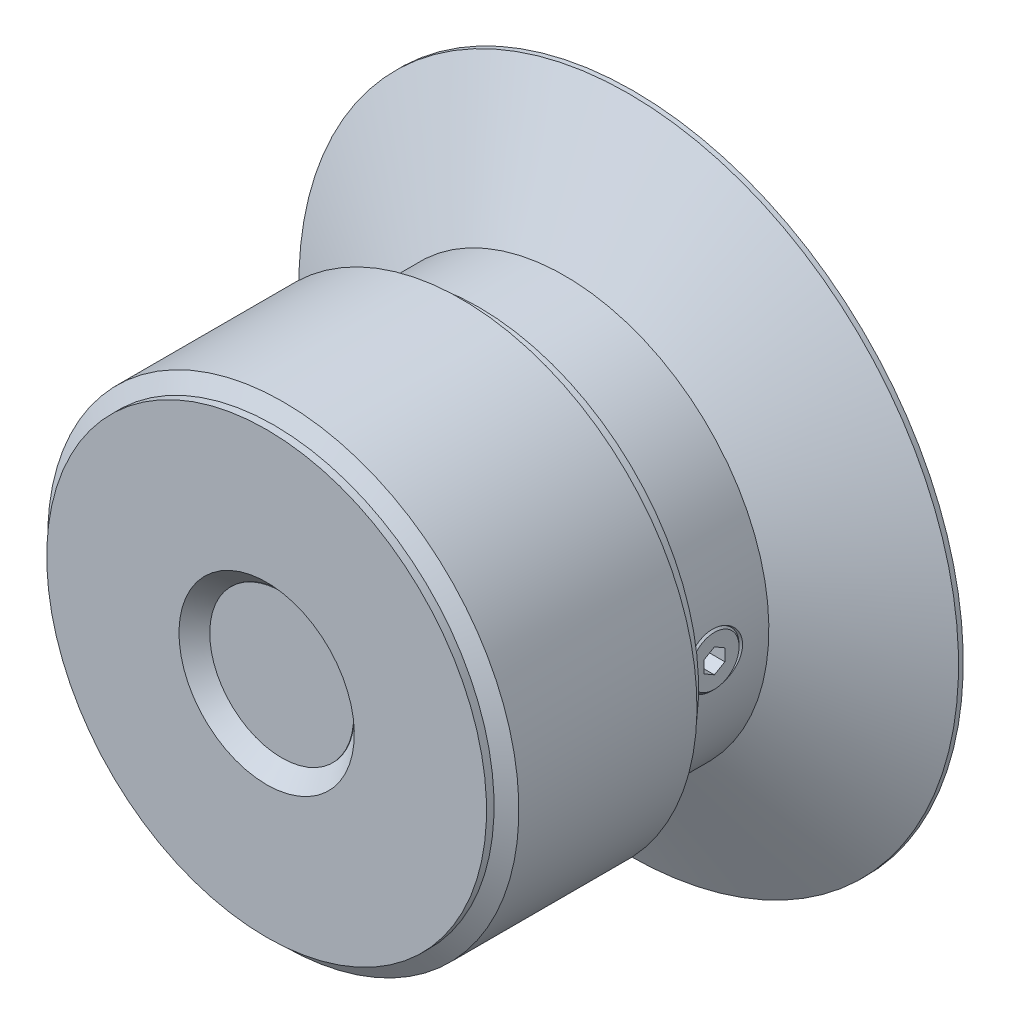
ISO-10303-21;
HEADER;
FILE_DESCRIPTION(('STEP AP214'),'2;1');
FILE_NAME('part.step','',(''),(''),'','','');
FILE_SCHEMA(('AUTOMOTIVE_DESIGN { 1 0 10303 214 1 1 1 1 }'));
ENDSEC;
DATA;
#1=APPLICATION_CONTEXT('core data for automotive mechanical design processes');
#2=APPLICATION_PROTOCOL_DEFINITION('international standard','automotive_design',2000,#1);
#3=PRODUCT_CONTEXT('',#1,'mechanical');
#4=PRODUCT('Part','Part','',(#3));
#5=PRODUCT_RELATED_PRODUCT_CATEGORY('part','',(#4));
#6=PRODUCT_DEFINITION_FORMATION('','',#4);
#7=PRODUCT_DEFINITION_CONTEXT('part definition',#1,'design');
#8=PRODUCT_DEFINITION('design','',#6,#7);
#9=PRODUCT_DEFINITION_SHAPE('','',#8);
#10=(LENGTH_UNIT() NAMED_UNIT(*) SI_UNIT(.MILLI.,.METRE.));
#11=(NAMED_UNIT(*) PLANE_ANGLE_UNIT() SI_UNIT($,.RADIAN.));
#12=(NAMED_UNIT(*) SI_UNIT($,.STERADIAN.) SOLID_ANGLE_UNIT());
#13=UNCERTAINTY_MEASURE_WITH_UNIT(LENGTH_MEASURE(1.E-05),#10,'distance_accuracy_value','');
#14=(GEOMETRIC_REPRESENTATION_CONTEXT(3) GLOBAL_UNCERTAINTY_ASSIGNED_CONTEXT((#13)) GLOBAL_UNIT_ASSIGNED_CONTEXT((#10,
#11,#12)) REPRESENTATION_CONTEXT('',''));
#15=CARTESIAN_POINT('',(0.,0.,0.));
#16=DIRECTION('',(0.,0.,1.));
#17=DIRECTION('',(1.,0.,0.));
#18=AXIS2_PLACEMENT_3D('',#15,#16,#17);
#19=CARTESIAN_POINT('',(0.,0.,15.7320508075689));
#20=DIRECTION('',(0.,0.,1.));
#21=DIRECTION('',(0.,-1.,0.));
#22=AXIS2_PLACEMENT_3D('',#19,#20,#21);
#23=CYLINDRICAL_SURFACE('',#22,3.);
#24=CARTESIAN_POINT('',(0.,0.,0.2));
#25=DIRECTION('',(0.,0.,1.));
#26=DIRECTION('',(0.,-1.,0.));
#27=AXIS2_PLACEMENT_3D('',#24,#25,#26);
#28=CIRCLE('',#27,3.);
#29=CARTESIAN_POINT('',(0.,-3.,0.2));
#30=VERTEX_POINT('',#29);
#31=EDGE_CURVE('E138',#30,#30,#28,.T.);
#32=ORIENTED_EDGE('',*,*,#31,.F.);
#33=EDGE_LOOP('',(#32));
#34=FACE_BOUND('',#33,.T.);
#35=CARTESIAN_POINT('',(0.,0.,14.));
#36=DIRECTION('',(0.,0.,-1.));
#37=DIRECTION('',(0.,1.,0.));
#38=AXIS2_PLACEMENT_3D('',#35,#36,#37);
#39=CIRCLE('',#38,3.);
#40=CARTESIAN_POINT('',(0.,3.,14.));
#41=VERTEX_POINT('',#40);
#42=EDGE_CURVE('E90',#41,#41,#39,.T.);
#43=ORIENTED_EDGE('',*,*,#42,.F.);
#44=EDGE_LOOP('',(#43));
#45=FACE_BOUND('',#44,.T.);
#46=ADVANCED_FACE('F14',(#34,#45),#23,.F.);
#47=CARTESIAN_POINT('',(0.,0.,0.));
#48=DIRECTION('',(0.,0.,-1.));
#49=DIRECTION('',(0.,1.,0.));
#50=AXIS2_PLACEMENT_3D('',#47,#48,#49);
#51=CONICAL_SURFACE('',#50,3.2,0.785398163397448);
#52=ORIENTED_EDGE('',*,*,#31,.T.);
#53=EDGE_LOOP('',(#52));
#54=FACE_BOUND('',#53,.T.);
#55=CARTESIAN_POINT('',(0.,0.,0.));
#56=DIRECTION('',(0.,0.,1.));
#57=DIRECTION('',(0.,-1.,0.));
#58=AXIS2_PLACEMENT_3D('',#55,#56,#57);
#59=CIRCLE('',#58,3.2);
#60=CARTESIAN_POINT('',(0.,-3.2,0.));
#61=VERTEX_POINT('',#60);
#62=EDGE_CURVE('E141',#61,#61,#59,.T.);
#63=ORIENTED_EDGE('',*,*,#62,.F.);
#64=EDGE_LOOP('',(#63));
#65=FACE_BOUND('',#64,.T.);
#66=ADVANCED_FACE('F165',(#54,#65),#51,.F.);
#67=CARTESIAN_POINT('',(0.,0.,0.));
#68=DIRECTION('',(0.,0.,1.));
#69=DIRECTION('',(0.,-1.,0.));
#70=AXIS2_PLACEMENT_3D('',#67,#68,#69);
#71=PLANE('',#70);
#72=CARTESIAN_POINT('',(0.,0.,0.));
#73=DIRECTION('',(0.,0.,1.));
#74=DIRECTION('',(0.,-1.,0.));
#75=AXIS2_PLACEMENT_3D('',#72,#73,#74);
#76=CIRCLE('',#75,6.);
#77=CARTESIAN_POINT('',(0.,-6.,0.));
#78=VERTEX_POINT('',#77);
#79=EDGE_CURVE('E509',#78,#78,#76,.T.);
#80=ORIENTED_EDGE('',*,*,#79,.F.);
#81=EDGE_LOOP('',(#80));
#82=FACE_BOUND('',#81,.T.);
#83=ORIENTED_EDGE('',*,*,#62,.T.);
#84=EDGE_LOOP('',(#83));
#85=FACE_BOUND('',#84,.T.);
#86=ADVANCED_FACE('F227',(#82,#85),#71,.F.);
#87=CARTESIAN_POINT('',(0.,0.,24.));
#88=DIRECTION('',(0.,0.,1.));
#89=DIRECTION('',(0.,-1.,0.));
#90=AXIS2_PLACEMENT_3D('',#87,#88,#89);
#91=CYLINDRICAL_SURFACE('',#90,6.);
#92=CARTESIAN_POINT('',(0.,0.,0.3));
#93=DIRECTION('',(0.,0.,1.));
#94=DIRECTION('',(0.,-1.,0.));
#95=AXIS2_PLACEMENT_3D('',#92,#93,#94);
#96=CIRCLE('',#95,6.);
#97=CARTESIAN_POINT('',(0.,-6.,0.3));
#98=VERTEX_POINT('',#97);
#99=EDGE_CURVE('E506',#98,#98,#96,.T.);
#100=ORIENTED_EDGE('',*,*,#99,.F.);
#101=EDGE_LOOP('',(#100));
#102=FACE_BOUND('',#101,.T.);
#103=ORIENTED_EDGE('',*,*,#79,.T.);
#104=EDGE_LOOP('',(#103));
#105=FACE_BOUND('',#104,.T.);
#106=ADVANCED_FACE('F163',(#102,#105),#91,.T.);
#107=CARTESIAN_POINT('',(13.2,0.,8.5));
#108=DIRECTION('',(1.,0.,0.));
#109=DIRECTION('',(0.,0.,-1.));
#110=AXIS2_PLACEMENT_3D('',#107,#108,#109);
#111=CONICAL_SURFACE('',#110,2.,0.78539816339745);
#112=CARTESIAN_POINT('',(12.9431972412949,-1.2139378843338,7.24896385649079));
#113=CARTESIAN_POINT('',(12.9486321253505,-1.15598715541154,7.18515845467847));
#114=CARTESIAN_POINT('',(12.95411531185,-1.09333814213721,7.12561511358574));
#115=CARTESIAN_POINT('',(12.9646981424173,-0.959734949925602,7.01659920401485));
#116=CARTESIAN_POINT('',(12.9697976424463,-0.888777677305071,6.96713040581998));
#117=CARTESIAN_POINT('',(12.9796922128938,-0.731114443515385,6.8745582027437));
#118=CARTESIAN_POINT('',(12.9843791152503,-0.643539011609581,6.83290954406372));
#119=CARTESIAN_POINT('',(12.9920939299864,-0.462285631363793,6.76586842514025));
#120=CARTESIAN_POINT('',(12.9951219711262,-0.368608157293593,6.74047470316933));
#121=CARTESIAN_POINT('',(12.9990116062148,-0.183704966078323,6.70807803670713));
#122=CARTESIAN_POINT('',(12.9999889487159,-0.0926534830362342,6.700091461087));
#123=CARTESIAN_POINT('',(13.0000108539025,0.089449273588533,6.69991016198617));
#124=CARTESIAN_POINT('',(12.9990559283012,0.180500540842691,6.70771125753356));
#125=CARTESIAN_POINT('',(12.9953821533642,0.357267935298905,6.73830549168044));
#126=CARTESIAN_POINT('',(12.9927152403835,0.443062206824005,6.76065747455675));
#127=CARTESIAN_POINT('',(12.9859588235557,0.609788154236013,6.81904806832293));
#128=CARTESIAN_POINT('',(12.9818691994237,0.690719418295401,6.85508783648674));
#129=CARTESIAN_POINT('',(12.9725844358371,0.847571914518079,6.94057061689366));
#130=CARTESIAN_POINT('',(12.9673654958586,0.923329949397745,6.99030972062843));
#131=CARTESIAN_POINT('',(12.9564197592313,1.06598100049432,7.10113316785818));
#132=CARTESIAN_POINT('',(12.9506928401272,1.13287186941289,7.16222025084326));
#133=CARTESIAN_POINT('',(12.9389544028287,1.2600718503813,7.29780227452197));
#134=CARTESIAN_POINT('',(12.9329457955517,1.31976847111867,7.37287188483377));
#135=CARTESIAN_POINT('',(12.9216017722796,1.42656910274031,7.53153062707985));
#136=CARTESIAN_POINT('',(12.9162665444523,1.47366959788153,7.61512212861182));
#137=CARTESIAN_POINT('',(12.9065129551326,1.55685279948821,7.79384493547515));
#138=CARTESIAN_POINT('',(12.902168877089,1.59210418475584,7.88936776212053));
#139=CARTESIAN_POINT('',(12.8952989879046,1.64682337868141,8.08489536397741));
#140=CARTESIAN_POINT('',(12.8927735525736,1.66628792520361,8.18490106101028));
#141=CARTESIAN_POINT('',(12.8897539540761,1.68949455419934,8.39056335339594));
#142=CARTESIAN_POINT('',(12.8893395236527,1.69261960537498,8.49629121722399));
#143=CARTESIAN_POINT('',(12.8908053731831,1.68141790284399,8.70681077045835));
#144=CARTESIAN_POINT('',(12.8926859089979,1.6670892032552,8.81160235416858));
#145=CARTESIAN_POINT('',(12.8985577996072,1.62103305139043,9.01832956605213));
#146=CARTESIAN_POINT('',(12.9025698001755,1.58913530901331,9.1202268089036));
#147=CARTESIAN_POINT('',(12.9122474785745,1.50847810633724,9.31705123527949));
#148=CARTESIAN_POINT('',(12.9179131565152,1.45971864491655,9.41197841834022));
#149=CARTESIAN_POINT('',(12.9301074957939,1.34738479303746,9.59027531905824));
#150=CARTESIAN_POINT('',(12.9366194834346,1.28408204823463,9.67381694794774));
#151=CARTESIAN_POINT('',(12.9497856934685,1.14367968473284,9.82838089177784));
#152=CARTESIAN_POINT('',(12.9564398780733,1.06658369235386,9.89940648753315));
#153=CARTESIAN_POINT('',(12.9687264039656,0.904652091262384,10.023101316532));
#154=CARTESIAN_POINT('',(12.9743926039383,0.820371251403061,10.0764922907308));
#155=CARTESIAN_POINT('',(12.9843644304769,0.64350485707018,10.1672429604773));
#156=CARTESIAN_POINT('',(12.9886707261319,0.550923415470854,10.2046105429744));
#157=CARTESIAN_POINT('',(12.9951321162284,0.366698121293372,10.2597300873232));
#158=CARTESIAN_POINT('',(12.9974106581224,0.275397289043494,10.2786160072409));
#159=CARTESIAN_POINT('',(13.0000092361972,0.0908797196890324,10.3001087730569));
#160=CARTESIAN_POINT('',(13.0003298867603,-0.00233640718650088,10.3027207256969));
#161=CARTESIAN_POINT('',(12.9990054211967,-0.183619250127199,10.2918100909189));
#162=CARTESIAN_POINT('',(12.9974471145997,-0.271730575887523,10.2790000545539));
#163=CARTESIAN_POINT('',(12.9926844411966,-0.444552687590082,10.2389514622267));
#164=CARTESIAN_POINT('',(12.9894800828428,-0.529263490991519,10.2117129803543));
#165=CARTESIAN_POINT('',(12.9817461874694,-0.693604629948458,10.1436187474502));
#166=CARTESIAN_POINT('',(12.9772078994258,-0.773197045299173,10.1026728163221));
#167=CARTESIAN_POINT('',(12.9672876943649,-0.924786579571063,10.0086453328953));
#168=CARTESIAN_POINT('',(12.9619056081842,-0.996782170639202,9.95556134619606));
#169=CARTESIAN_POINT('',(12.9505479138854,-1.13506323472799,9.83595881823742));
#170=CARTESIAN_POINT('',(12.9445560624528,-1.20087773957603,9.76889783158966));
#171=CARTESIAN_POINT('',(12.9328387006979,-1.32111359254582,9.62522707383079));
#172=CARTESIAN_POINT('',(12.9271132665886,-1.37553169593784,9.54861459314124));
#173=CARTESIAN_POINT('',(12.9161522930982,-1.47501837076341,9.38282948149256));
#174=CARTESIAN_POINT('',(12.9109703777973,-1.51928144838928,9.29316954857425));
#175=CARTESIAN_POINT('',(12.9020876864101,-1.59295783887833,9.10787719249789));
#176=CARTESIAN_POINT('',(12.8983872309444,-1.62236793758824,9.01224348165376));
#177=CARTESIAN_POINT('',(12.8927224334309,-1.66680583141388,8.81297257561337));
#178=CARTESIAN_POINT('',(12.8908463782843,-1.68110490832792,8.70916981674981));
#179=CARTESIAN_POINT('',(12.8893456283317,-1.69257262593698,8.50058694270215));
#180=CARTESIAN_POINT('',(12.889721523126,-1.68973678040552,8.39580657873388));
#181=CARTESIAN_POINT('',(12.8927120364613,-1.66676732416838,8.18617317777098));
#182=CARTESIAN_POINT('',(12.8953689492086,-1.64630689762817,8.08135639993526));
#183=CARTESIAN_POINT('',(12.9026710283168,-1.58806063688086,7.87674996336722));
#184=CARTESIAN_POINT('',(12.9073151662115,-1.55028376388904,7.77695773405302));
#185=CARTESIAN_POINT('',(12.9170722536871,-1.46651756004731,7.60264189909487));
#186=CARTESIAN_POINT('',(12.9219511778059,-1.4232219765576,7.52679908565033));
#187=CARTESIAN_POINT('',(12.9322695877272,-1.32619043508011,7.3821790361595));
#188=CARTESIAN_POINT('',(12.9377087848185,-1.27245984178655,7.31339819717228));
#189=CARTESIAN_POINT('',(12.9431972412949,-1.2139378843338,7.24896385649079));
#190=B_SPLINE_CURVE_WITH_KNOTS('',3,(#112,#113,#114,#115,#116,#117,#118,#119,#120,#121,#122,
#123,#124,#125,#126,#127,#128,#129,#130,#131,#132,#133,#134,#135,#136,#137,#138,#139,#140,#141,
#142,#143,#144,#145,#146,#147,#148,#149,#150,#151,#152,#153,#154,#155,#156,#157,#158,#159,#160,
#161,#162,#163,#164,#165,#166,#167,#168,#169,#170,#171,#172,#173,#174,#175,#176,#177,#178,#179,
#180,#181,#182,#183,#184,#185,#186,#187,#188,#189),.UNSPECIFIED.,.T.,.F.,(4,2,2,2,2,2,2,2,2,2,2,
2,2,2,2,2,2,2,2,2,2,2,2,2,2,2,2,2,2,2,2,2,2,2,2,2,2,2,4),(0.,0.258856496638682,
0.517809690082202,0.807531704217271,1.0972312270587,1.37008332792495,1.64286318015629,
1.90773549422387,2.17263020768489,2.44377298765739,2.71498130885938,3.00202784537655,
3.28915441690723,3.59352050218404,3.89794946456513,4.21379569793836,4.52967714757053,
4.84867561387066,5.16767410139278,5.48113933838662,5.79452228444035,6.09274637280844,
6.39082350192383,6.66918488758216,6.94745891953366,7.21335437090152,7.47924845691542,
7.74692738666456,8.01466004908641,8.29589258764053,8.57720508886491,8.87624874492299,
9.17535708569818,9.4883101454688,9.80134514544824,10.1203129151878,10.4391158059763,
10.7006579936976,10.9620660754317),.UNSPECIFIED.);
#191=CARTESIAN_POINT('',(12.9431972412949,-1.2139378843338,7.24896385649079));
#192=VERTEX_POINT('',#191);
#193=EDGE_CURVE('E144',#192,#192,#190,.T.);
#194=ORIENTED_EDGE('',*,*,#193,.T.);
#195=EDGE_LOOP('',(#194));
#196=FACE_BOUND('',#195,.T.);
#197=CARTESIAN_POINT('',(12.8880760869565,0.,8.5));
#198=DIRECTION('',(-1.,0.,0.));
#199=DIRECTION('',(0.,-1.,0.));
#200=AXIS2_PLACEMENT_3D('',#197,#198,#199);
#201=CIRCLE('',#200,1.68807608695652);
#202=CARTESIAN_POINT('',(12.8880760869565,-1.68807608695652,8.5));
#203=VERTEX_POINT('',#202);
#204=EDGE_CURVE('E9',#203,#203,#201,.T.);
#205=ORIENTED_EDGE('',*,*,#204,.T.);
#206=EDGE_LOOP('',(#205));
#207=FACE_BOUND('',#206,.T.);
#208=ADVANCED_FACE('F158',(#196,#207),#111,.F.);
#209=CARTESIAN_POINT('',(0.,0.,24.));
#210=DIRECTION('',(0.,0.,1.));
#211=DIRECTION('',(0.,-1.,0.));
#212=AXIS2_PLACEMENT_3D('',#209,#210,#211);
#213=CYLINDRICAL_SURFACE('',#212,13.);
#214=CARTESIAN_POINT('',(0.,0.,10.5));
#215=DIRECTION('',(0.,0.,1.));
#216=DIRECTION('',(0.,-1.,0.));
#217=AXIS2_PLACEMENT_3D('',#214,#215,#216);
#218=CIRCLE('',#217,13.);
#219=CARTESIAN_POINT('',(0.,-13.,10.5));
#220=VERTEX_POINT('',#219);
#221=EDGE_CURVE('E491',#220,#220,#218,.T.);
#222=ORIENTED_EDGE('',*,*,#221,.F.);
#223=EDGE_LOOP('',(#222));
#224=FACE_BOUND('',#223,.T.);
#225=ORIENTED_EDGE('',*,*,#193,.F.);
#226=EDGE_LOOP('',(#225));
#227=FACE_BOUND('',#226,.T.);
#228=CARTESIAN_POINT('',(0.,0.,5.02620359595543));
#229=DIRECTION('',(0.,0.,1.));
#230=DIRECTION('',(0.,-1.,0.));
#231=AXIS2_PLACEMENT_3D('',#228,#229,#230);
#232=CIRCLE('',#231,13.);
#233=CARTESIAN_POINT('',(0.,-13.,5.02620359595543));
#234=VERTEX_POINT('',#233);
#235=EDGE_CURVE('E494',#234,#234,#232,.T.);
#236=ORIENTED_EDGE('',*,*,#235,.T.);
#237=EDGE_LOOP('',(#236));
#238=FACE_BOUND('',#237,.T.);
#239=ADVANCED_FACE('F154',(#224,#227,#238),#213,.T.);
#240=CARTESIAN_POINT('',(13.,0.,10.5));
#241=DIRECTION('',(0.,0.,1.));
#242=DIRECTION('',(0.,-1.,0.));
#243=AXIS2_PLACEMENT_3D('',#240,#241,#242);
#244=PLANE('',#243);
#245=CARTESIAN_POINT('',(0.,0.,10.5));
#246=DIRECTION('',(0.,0.,1.));
#247=DIRECTION('',(0.,-1.,0.));
#248=AXIS2_PLACEMENT_3D('',#245,#246,#247);
#249=CIRCLE('',#248,14.);
#250=CARTESIAN_POINT('',(0.,-14.,10.5));
#251=VERTEX_POINT('',#250);
#252=EDGE_CURVE('E485',#251,#251,#249,.T.);
#253=ORIENTED_EDGE('',*,*,#252,.F.);
#254=EDGE_LOOP('',(#253));
#255=FACE_BOUND('',#254,.T.);
#256=ORIENTED_EDGE('',*,*,#221,.T.);
#257=EDGE_LOOP('',(#256));
#258=FACE_BOUND('',#257,.T.);
#259=ADVANCED_FACE('F194',(#255,#258),#244,.F.);
#260=CARTESIAN_POINT('',(0.,0.,0.95));
#261=DIRECTION('',(0.,0.,-1.));
#262=DIRECTION('',(0.,1.,0.));
#263=AXIS2_PLACEMENT_3D('',#260,#261,#262);
#264=CONICAL_SURFACE('',#263,21.,1.09955742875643);
#265=ORIENTED_EDGE('',*,*,#235,.F.);
#266=EDGE_LOOP('',(#265));
#267=FACE_BOUND('',#266,.T.);
#268=CARTESIAN_POINT('',(0.,0.,0.95));
#269=DIRECTION('',(0.,0.,1.));
#270=DIRECTION('',(0.,-1.,0.));
#271=AXIS2_PLACEMENT_3D('',#268,#269,#270);
#272=CIRCLE('',#271,21.);
#273=CARTESIAN_POINT('',(0.,-21.,0.95));
#274=VERTEX_POINT('',#273);
#275=EDGE_CURVE('E497',#274,#274,#272,.T.);
#276=ORIENTED_EDGE('',*,*,#275,.T.);
#277=EDGE_LOOP('',(#276));
#278=FACE_BOUND('',#277,.T.);
#279=ADVANCED_FACE('F192',(#267,#278),#264,.T.);
#280=CARTESIAN_POINT('',(0.,0.,24.));
#281=DIRECTION('',(0.,0.,1.));
#282=DIRECTION('',(0.,-1.,0.));
#283=AXIS2_PLACEMENT_3D('',#280,#281,#282);
#284=CYLINDRICAL_SURFACE('',#283,14.);
#285=CARTESIAN_POINT('',(0.,0.,11.28));
#286=DIRECTION('',(0.,0.,1.));
#287=DIRECTION('',(0.,-1.,0.));
#288=AXIS2_PLACEMENT_3D('',#285,#286,#287);
#289=CIRCLE('',#288,14.);
#290=CARTESIAN_POINT('',(0.,-14.,11.28));
#291=VERTEX_POINT('',#290);
#292=EDGE_CURVE('E481',#291,#291,#289,.T.);
#293=ORIENTED_EDGE('',*,*,#292,.F.);
#294=EDGE_LOOP('',(#293));
#295=FACE_BOUND('',#294,.T.);
#296=ORIENTED_EDGE('',*,*,#252,.T.);
#297=EDGE_LOOP('',(#296));
#298=FACE_BOUND('',#297,.T.);
#299=ADVANCED_FACE('F190',(#295,#298),#284,.T.);
#300=CARTESIAN_POINT('',(0.,0.,24.));
#301=DIRECTION('',(0.,0.,1.));
#302=DIRECTION('',(0.,-1.,0.));
#303=AXIS2_PLACEMENT_3D('',#300,#301,#302);
#304=CYLINDRICAL_SURFACE('',#303,21.);
#305=ORIENTED_EDGE('',*,*,#275,.F.);
#306=EDGE_LOOP('',(#305));
#307=FACE_BOUND('',#306,.T.);
#308=CARTESIAN_POINT('',(0.,0.,0.65));
#309=DIRECTION('',(0.,0.,1.));
#310=DIRECTION('',(0.,-1.,0.));
#311=AXIS2_PLACEMENT_3D('',#308,#309,#310);
#312=CIRCLE('',#311,21.);
#313=CARTESIAN_POINT('',(0.,-21.,0.65));
#314=VERTEX_POINT('',#313);
#315=EDGE_CURVE('E500',#314,#314,#312,.T.);
#316=ORIENTED_EDGE('',*,*,#315,.T.);
#317=EDGE_LOOP('',(#316));
#318=FACE_BOUND('',#317,.T.);
#319=ADVANCED_FACE('F188',(#307,#318),#304,.T.);
#320=CARTESIAN_POINT('',(14.,0.,11.28));
#321=DIRECTION('',(0.,0.,1.));
#322=DIRECTION('',(0.,-1.,0.));
#323=AXIS2_PLACEMENT_3D('',#320,#321,#322);
#324=PLANE('',#323);
#325=CARTESIAN_POINT('',(0.,0.,11.28));
#326=DIRECTION('',(0.,0.,1.));
#327=DIRECTION('',(0.,-1.,0.));
#328=AXIS2_PLACEMENT_3D('',#325,#326,#327);
#329=CIRCLE('',#328,14.4416729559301);
#330=CARTESIAN_POINT('',(0.,-14.4416729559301,11.28));
#331=VERTEX_POINT('',#330);
#332=EDGE_CURVE('E133',#331,#331,#329,.F.);
#333=ORIENTED_EDGE('',*,*,#332,.T.);
#334=EDGE_LOOP('',(#333));
#335=FACE_BOUND('',#334,.T.);
#336=ORIENTED_EDGE('',*,*,#292,.T.);
#337=EDGE_LOOP('',(#336));
#338=FACE_BOUND('',#337,.T.);
#339=ADVANCED_FACE('F184',(#335,#338),#324,.F.);
#340=CARTESIAN_POINT('',(6.6,0.,0.65));
#341=DIRECTION('',(0.,0.,1.));
#342=DIRECTION('',(0.,-1.,0.));
#343=AXIS2_PLACEMENT_3D('',#340,#341,#342);
#344=PLANE('',#343);
#345=ORIENTED_EDGE('',*,*,#315,.F.);
#346=EDGE_LOOP('',(#345));
#347=FACE_BOUND('',#346,.T.);
#348=CARTESIAN_POINT('',(0.,0.,0.65));
#349=DIRECTION('',(0.,0.,1.));
#350=DIRECTION('',(0.,-1.,0.));
#351=AXIS2_PLACEMENT_3D('',#348,#349,#350);
#352=CIRCLE('',#351,6.6);
#353=CARTESIAN_POINT('',(0.,-6.6,0.65));
#354=VERTEX_POINT('',#353);
#355=EDGE_CURVE('E503',#354,#354,#352,.T.);
#356=ORIENTED_EDGE('',*,*,#355,.T.);
#357=EDGE_LOOP('',(#356));
#358=FACE_BOUND('',#357,.T.);
#359=ADVANCED_FACE('F187',(#347,#358),#344,.F.);
#360=CARTESIAN_POINT('',(0.,0.,11.025));
#361=DIRECTION('',(0.,0.,1.));
#362=DIRECTION('',(0.,-1.,0.));
#363=AXIS2_PLACEMENT_3D('',#360,#361,#362);
#364=CONICAL_SURFACE('',#363,14.,1.0471975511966);
#365=ORIENTED_EDGE('',*,*,#332,.F.);
#366=EDGE_LOOP('',(#365));
#367=FACE_BOUND('',#366,.T.);
#368=CARTESIAN_POINT('',(0.,0.,11.6023502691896));
#369=DIRECTION('',(0.,0.,1.));
#370=DIRECTION('',(0.,-1.,0.));
#371=AXIS2_PLACEMENT_3D('',#368,#369,#370);
#372=CIRCLE('',#371,15.);
#373=CARTESIAN_POINT('',(0.,-15.,11.6023502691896));
#374=VERTEX_POINT('',#373);
#375=EDGE_CURVE('E128',#374,#374,#372,.T.);
#376=ORIENTED_EDGE('',*,*,#375,.F.);
#377=EDGE_LOOP('',(#376));
#378=FACE_BOUND('',#377,.T.);
#379=ADVANCED_FACE('F209',(#367,#378),#364,.T.);
#380=CARTESIAN_POINT('',(0.,0.,0.3));
#381=DIRECTION('',(0.,0.,1.));
#382=DIRECTION('',(0.,-1.,0.));
#383=AXIS2_PLACEMENT_3D('',#380,#381,#382);
#384=CONICAL_SURFACE('',#383,6.,1.04272187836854);
#385=ORIENTED_EDGE('',*,*,#355,.F.);
#386=EDGE_LOOP('',(#385));
#387=FACE_BOUND('',#386,.T.);
#388=ORIENTED_EDGE('',*,*,#99,.T.);
#389=EDGE_LOOP('',(#388));
#390=FACE_BOUND('',#389,.T.);
#391=ADVANCED_FACE('F206',(#387,#390),#384,.T.);
#392=CARTESIAN_POINT('',(13.005652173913,0.,8.5));
#393=DIRECTION('',(-1.,0.,0.));
#394=DIRECTION('',(0.,-1.,0.));
#395=AXIS2_PLACEMENT_3D('',#392,#393,#394);
#396=CONICAL_SURFACE('',#395,1.5705,0.785398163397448);
#397=ORIENTED_EDGE('',*,*,#204,.F.);
#398=EDGE_LOOP('',(#397));
#399=FACE_BOUND('',#398,.T.);
#400=CARTESIAN_POINT('',(13.005652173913,0.,8.5));
#401=DIRECTION('',(-1.,0.,0.));
#402=DIRECTION('',(0.,-1.,0.));
#403=AXIS2_PLACEMENT_3D('',#400,#401,#402);
#404=CIRCLE('',#403,1.5705);
#405=CARTESIAN_POINT('',(13.005652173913,-1.5705,8.5));
#406=VERTEX_POINT('',#405);
#407=EDGE_CURVE('E74',#406,#406,#404,.T.);
#408=ORIENTED_EDGE('',*,*,#407,.T.);
#409=EDGE_LOOP('',(#408));
#410=FACE_BOUND('',#409,.T.);
#411=ADVANCED_FACE('F208',(#399,#410),#396,.T.);
#412=CARTESIAN_POINT('',(13.005652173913,0.,8.5));
#413=DIRECTION('',(-1.,0.,0.));
#414=DIRECTION('',(0.,-1.,0.));
#415=AXIS2_PLACEMENT_3D('',#412,#413,#414);
#416=PLANE('',#415);
#417=ORIENTED_EDGE('',*,*,#407,.F.);
#418=EDGE_LOOP('',(#417));
#419=FACE_BOUND('',#418,.T.);
#420=DIRECTION('',(0.,1.,0.));
#421=VECTOR('',#420,1.);
#422=CARTESIAN_POINT('',(13.005652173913,0.,7.83333333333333));
#423=LINE('',#422,#421);
#424=CARTESIAN_POINT('',(13.005652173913,-0.384900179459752,7.83333333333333));
#425=VERTEX_POINT('',#424);
#426=CARTESIAN_POINT('',(13.005652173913,0.384900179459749,7.83333333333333));
#427=VERTEX_POINT('',#426);
#428=EDGE_CURVE('E18',#425,#427,#423,.T.);
#429=ORIENTED_EDGE('',*,*,#428,.F.);
#430=DIRECTION('',(0.,0.5,-0.866025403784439));
#431=VECTOR('',#430,1.);
#432=CARTESIAN_POINT('',(13.005652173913,-0.577350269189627,8.16666666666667));
#433=LINE('',#432,#431);
#434=CARTESIAN_POINT('',(13.005652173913,-0.769800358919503,8.5));
#435=VERTEX_POINT('',#434);
#436=EDGE_CURVE('E114',#435,#425,#433,.T.);
#437=ORIENTED_EDGE('',*,*,#436,.F.);
#438=DIRECTION('',(0.,-0.5,-0.866025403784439));
#439=VECTOR('',#438,1.);
#440=CARTESIAN_POINT('',(13.005652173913,-0.577350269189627,8.83333333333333));
#441=LINE('',#440,#439);
#442=CARTESIAN_POINT('',(13.005652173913,-0.384900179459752,9.16666666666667));
#443=VERTEX_POINT('',#442);
#444=EDGE_CURVE('E116',#443,#435,#441,.T.);
#445=ORIENTED_EDGE('',*,*,#444,.F.);
#446=DIRECTION('',(0.,-1.,0.));
#447=VECTOR('',#446,1.);
#448=CARTESIAN_POINT('',(13.005652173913,0.,9.16666666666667));
#449=LINE('',#448,#447);
#450=CARTESIAN_POINT('',(13.005652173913,0.384900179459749,9.16666666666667));
#451=VERTEX_POINT('',#450);
#452=EDGE_CURVE('E118',#451,#443,#449,.T.);
#453=ORIENTED_EDGE('',*,*,#452,.F.);
#454=DIRECTION('',(0.,-0.5,0.866025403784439));
#455=VECTOR('',#454,1.);
#456=CARTESIAN_POINT('',(13.005652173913,0.577350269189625,8.83333333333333));
#457=LINE('',#456,#455);
#458=CARTESIAN_POINT('',(13.005652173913,0.7698003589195,8.5));
#459=VERTEX_POINT('',#458);
#460=EDGE_CURVE('E120',#459,#451,#457,.T.);
#461=ORIENTED_EDGE('',*,*,#460,.F.);
#462=DIRECTION('',(0.,0.5,0.866025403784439));
#463=VECTOR('',#462,1.);
#464=CARTESIAN_POINT('',(13.005652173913,0.577350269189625,8.16666666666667));
#465=LINE('',#464,#463);
#466=EDGE_CURVE('E122',#427,#459,#465,.T.);
#467=ORIENTED_EDGE('',*,*,#466,.F.);
#468=EDGE_LOOP('',(#429,#437,#445,#453,#461,#467));
#469=FACE_BOUND('',#468,.T.);
#470=ADVANCED_FACE('F16',(#419,#469),#416,.F.);
#471=CARTESIAN_POINT('',(15.,-0.384900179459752,7.83333333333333));
#472=DIRECTION('',(0.,0.,1.));
#473=DIRECTION('',(0.,-1.,0.));
#474=AXIS2_PLACEMENT_3D('',#471,#472,#473);
#475=PLANE('',#474);
#476=ORIENTED_EDGE('',*,*,#428,.T.);
#477=DIRECTION('',(-1.,0.,0.));
#478=VECTOR('',#477,1.);
#479=CARTESIAN_POINT('',(15.,0.384900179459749,7.83333333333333));
#480=LINE('',#479,#478);
#481=CARTESIAN_POINT('',(11.,0.384900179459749,7.83333333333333));
#482=VERTEX_POINT('',#481);
#483=EDGE_CURVE('E67',#427,#482,#480,.T.);
#484=ORIENTED_EDGE('',*,*,#483,.T.);
#485=DIRECTION('',(0.,1.,0.));
#486=VECTOR('',#485,1.);
#487=CARTESIAN_POINT('',(11.,-0.384900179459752,7.83333333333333));
#488=LINE('',#487,#486);
#489=CARTESIAN_POINT('',(11.,-0.384900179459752,7.83333333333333));
#490=VERTEX_POINT('',#489);
#491=EDGE_CURVE('E71',#490,#482,#488,.T.);
#492=ORIENTED_EDGE('',*,*,#491,.F.);
#493=DIRECTION('',(-1.,0.,0.));
#494=VECTOR('',#493,1.);
#495=CARTESIAN_POINT('',(15.,-0.384900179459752,7.83333333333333));
#496=LINE('',#495,#494);
#497=EDGE_CURVE('E104',#425,#490,#496,.T.);
#498=ORIENTED_EDGE('',*,*,#497,.F.);
#499=EDGE_LOOP('',(#476,#484,#492,#498));
#500=FACE_BOUND('',#499,.T.);
#501=ADVANCED_FACE('F69',(#500),#475,.T.);
#502=CARTESIAN_POINT('',(15.,-0.769800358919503,8.5));
#503=DIRECTION('',(0.,0.866025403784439,0.5));
#504=DIRECTION('',(0.,-0.5,0.866025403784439));
#505=AXIS2_PLACEMENT_3D('',#502,#503,#504);
#506=PLANE('',#505);
#507=ORIENTED_EDGE('',*,*,#436,.T.);
#508=ORIENTED_EDGE('',*,*,#497,.T.);
#509=DIRECTION('',(0.,0.5,-0.866025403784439));
#510=VECTOR('',#509,1.);
#511=CARTESIAN_POINT('',(11.,-0.769800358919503,8.5));
#512=LINE('',#511,#510);
#513=CARTESIAN_POINT('',(11.,-0.769800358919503,8.5));
#514=VERTEX_POINT('',#513);
#515=EDGE_CURVE('E89',#514,#490,#512,.T.);
#516=ORIENTED_EDGE('',*,*,#515,.F.);
#517=DIRECTION('',(-1.,0.,0.));
#518=VECTOR('',#517,1.);
#519=CARTESIAN_POINT('',(15.,-0.769800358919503,8.5));
#520=LINE('',#519,#518);
#521=EDGE_CURVE('E31',#435,#514,#520,.T.);
#522=ORIENTED_EDGE('',*,*,#521,.F.);
#523=EDGE_LOOP('',(#507,#508,#516,#522));
#524=FACE_BOUND('',#523,.T.);
#525=ADVANCED_FACE('F240',(#524),#506,.T.);
#526=CARTESIAN_POINT('',(15.,-0.384900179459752,9.16666666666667));
#527=DIRECTION('',(0.,0.866025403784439,-0.5));
#528=DIRECTION('',(0.,0.5,0.866025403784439));
#529=AXIS2_PLACEMENT_3D('',#526,#527,#528);
#530=PLANE('',#529);
#531=ORIENTED_EDGE('',*,*,#444,.T.);
#532=ORIENTED_EDGE('',*,*,#521,.T.);
#533=DIRECTION('',(0.,-0.5,-0.866025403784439));
#534=VECTOR('',#533,1.);
#535=CARTESIAN_POINT('',(11.,-0.384900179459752,9.16666666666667));
#536=LINE('',#535,#534);
#537=CARTESIAN_POINT('',(11.,-0.384900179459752,9.16666666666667));
#538=VERTEX_POINT('',#537);
#539=EDGE_CURVE('E101',#538,#514,#536,.T.);
#540=ORIENTED_EDGE('',*,*,#539,.F.);
#541=DIRECTION('',(-1.,0.,0.));
#542=VECTOR('',#541,1.);
#543=CARTESIAN_POINT('',(15.,-0.384900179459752,9.16666666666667));
#544=LINE('',#543,#542);
#545=EDGE_CURVE('E107',#443,#538,#544,.T.);
#546=ORIENTED_EDGE('',*,*,#545,.F.);
#547=EDGE_LOOP('',(#531,#532,#540,#546));
#548=FACE_BOUND('',#547,.T.);
#549=ADVANCED_FACE('F243',(#548),#530,.T.);
#550=CARTESIAN_POINT('',(15.,0.384900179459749,9.16666666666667));
#551=DIRECTION('',(0.,0.,-1.));
#552=DIRECTION('',(0.,1.,0.));
#553=AXIS2_PLACEMENT_3D('',#550,#551,#552);
#554=PLANE('',#553);
#555=DIRECTION('',(-1.,0.,0.));
#556=VECTOR('',#555,1.);
#557=CARTESIAN_POINT('',(15.,0.384900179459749,9.16666666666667));
#558=LINE('',#557,#556);
#559=CARTESIAN_POINT('',(11.,0.384900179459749,9.16666666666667));
#560=VERTEX_POINT('',#559);
#561=EDGE_CURVE('E109',#451,#560,#558,.T.);
#562=ORIENTED_EDGE('',*,*,#561,.F.);
#563=ORIENTED_EDGE('',*,*,#452,.T.);
#564=ORIENTED_EDGE('',*,*,#545,.T.);
#565=DIRECTION('',(0.,-1.,0.));
#566=VECTOR('',#565,1.);
#567=CARTESIAN_POINT('',(11.,0.384900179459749,9.16666666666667));
#568=LINE('',#567,#566);
#569=EDGE_CURVE('E98',#560,#538,#568,.T.);
#570=ORIENTED_EDGE('',*,*,#569,.F.);
#571=EDGE_LOOP('',(#562,#563,#564,#570));
#572=FACE_BOUND('',#571,.T.);
#573=ADVANCED_FACE('F246',(#572),#554,.T.);
#574=CARTESIAN_POINT('',(15.,0.7698003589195,8.5));
#575=DIRECTION('',(0.,-0.866025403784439,-0.5));
#576=DIRECTION('',(0.,0.5,-0.866025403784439));
#577=AXIS2_PLACEMENT_3D('',#574,#575,#576);
#578=PLANE('',#577);
#579=ORIENTED_EDGE('',*,*,#460,.T.);
#580=ORIENTED_EDGE('',*,*,#561,.T.);
#581=DIRECTION('',(0.,-0.5,0.866025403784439));
#582=VECTOR('',#581,1.);
#583=CARTESIAN_POINT('',(11.,0.7698003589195,8.5));
#584=LINE('',#583,#582);
#585=CARTESIAN_POINT('',(11.,0.7698003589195,8.5));
#586=VERTEX_POINT('',#585);
#587=EDGE_CURVE('E84',#586,#560,#584,.T.);
#588=ORIENTED_EDGE('',*,*,#587,.F.);
#589=DIRECTION('',(-1.,0.,0.));
#590=VECTOR('',#589,1.);
#591=CARTESIAN_POINT('',(15.,0.7698003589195,8.5));
#592=LINE('',#591,#590);
#593=EDGE_CURVE('E75',#459,#586,#592,.T.);
#594=ORIENTED_EDGE('',*,*,#593,.F.);
#595=EDGE_LOOP('',(#579,#580,#588,#594));
#596=FACE_BOUND('',#595,.T.);
#597=ADVANCED_FACE('F250',(#596),#578,.T.);
#598=CARTESIAN_POINT('',(15.,0.384900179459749,7.83333333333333));
#599=DIRECTION('',(0.,-0.866025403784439,0.5));
#600=DIRECTION('',(0.,-0.5,-0.866025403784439));
#601=AXIS2_PLACEMENT_3D('',#598,#599,#600);
#602=PLANE('',#601);
#603=ORIENTED_EDGE('',*,*,#466,.T.);
#604=ORIENTED_EDGE('',*,*,#593,.T.);
#605=DIRECTION('',(0.,0.5,0.866025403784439));
#606=VECTOR('',#605,1.);
#607=CARTESIAN_POINT('',(11.,0.384900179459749,7.83333333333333));
#608=LINE('',#607,#606);
#609=EDGE_CURVE('E78',#482,#586,#608,.T.);
#610=ORIENTED_EDGE('',*,*,#609,.F.);
#611=ORIENTED_EDGE('',*,*,#483,.F.);
#612=EDGE_LOOP('',(#603,#604,#610,#611));
#613=FACE_BOUND('',#612,.T.);
#614=ADVANCED_FACE('F79',(#613),#602,.T.);
#615=CARTESIAN_POINT('',(11.,0.,8.5));
#616=DIRECTION('',(1.,0.,0.));
#617=DIRECTION('',(0.,1.,0.));
#618=AXIS2_PLACEMENT_3D('',#615,#616,#617);
#619=PLANE('',#618);
#620=ORIENTED_EDGE('',*,*,#491,.T.);
#621=ORIENTED_EDGE('',*,*,#609,.T.);
#622=ORIENTED_EDGE('',*,*,#587,.T.);
#623=ORIENTED_EDGE('',*,*,#569,.T.);
#624=ORIENTED_EDGE('',*,*,#539,.T.);
#625=ORIENTED_EDGE('',*,*,#515,.T.);
#626=EDGE_LOOP('',(#620,#621,#622,#623,#624,#625));
#627=FACE_BOUND('',#626,.T.);
#628=ADVANCED_FACE('F87',(#627),#619,.T.);
#629=CARTESIAN_POINT('',(0.,0.,14.));
#630=DIRECTION('',(0.,0.,-1.));
#631=DIRECTION('',(0.,1.,0.));
#632=AXIS2_PLACEMENT_3D('',#629,#630,#631);
#633=PLANE('',#632);
#634=ORIENTED_EDGE('',*,*,#42,.T.);
#635=EDGE_LOOP('',(#634));
#636=FACE_BOUND('',#635,.T.);
#637=ADVANCED_FACE('F217',(#636),#633,.T.);
#638=CARTESIAN_POINT('',(4.58139534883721,0.,23.04));
#639=DIRECTION('',(0.,0.,-1.));
#640=DIRECTION('',(0.,1.,0.));
#641=AXIS2_PLACEMENT_3D('',#638,#639,#640);
#642=PLANE('',#641);
#643=CARTESIAN_POINT('',(0.,0.,23.04));
#644=DIRECTION('',(0.,0.,1.));
#645=DIRECTION('',(0.,-1.,0.));
#646=AXIS2_PLACEMENT_3D('',#643,#644,#645);
#647=CIRCLE('',#646,4.58139534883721);
#648=CARTESIAN_POINT('',(0.,-4.58139534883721,23.04));
#649=VERTEX_POINT('',#648);
#650=EDGE_CURVE('E95',#649,#649,#647,.T.);
#651=ORIENTED_EDGE('',*,*,#650,.T.);
#652=EDGE_LOOP('',(#651));
#653=FACE_BOUND('',#652,.T.);
#654=ADVANCED_FACE('F232',(#653),#642,.F.);
#655=CARTESIAN_POINT('',(0.,0.,23.04));
#656=DIRECTION('',(0.,0.,1.));
#657=DIRECTION('',(0.,-1.,0.));
#658=AXIS2_PLACEMENT_3D('',#655,#656,#657);
#659=CYLINDRICAL_SURFACE('',#658,4.58139534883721);
#660=ORIENTED_EDGE('',*,*,#650,.F.);
#661=EDGE_LOOP('',(#660));
#662=FACE_BOUND('',#661,.T.);
#663=CARTESIAN_POINT('',(0.,0.,23.));
#664=DIRECTION('',(0.,0.,1.));
#665=DIRECTION('',(0.,-1.,0.));
#666=AXIS2_PLACEMENT_3D('',#663,#664,#665);
#667=CIRCLE('',#666,4.58139534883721);
#668=CARTESIAN_POINT('',(0.,-4.58139534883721,23.));
#669=VERTEX_POINT('',#668);
#670=EDGE_CURVE('E23',#669,#669,#667,.T.);
#671=ORIENTED_EDGE('',*,*,#670,.T.);
#672=EDGE_LOOP('',(#671));
#673=FACE_BOUND('',#672,.T.);
#674=ADVANCED_FACE('F171',(#662,#673),#659,.T.);
#675=CARTESIAN_POINT('',(0.,0.,24.));
#676=DIRECTION('',(0.,0.,1.));
#677=DIRECTION('',(0.,-1.,0.));
#678=AXIS2_PLACEMENT_3D('',#675,#676,#677);
#679=CONICAL_SURFACE('',#678,5.58139534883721,0.785398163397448);
#680=CARTESIAN_POINT('',(0.,0.,24.));
#681=DIRECTION('',(0.,0.,1.));
#682=DIRECTION('',(0.,-1.,0.));
#683=AXIS2_PLACEMENT_3D('',#680,#681,#682);
#684=CIRCLE('',#683,5.58139534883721);
#685=CARTESIAN_POINT('',(0.,-5.58139534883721,24.));
#686=VERTEX_POINT('',#685);
#687=EDGE_CURVE('E152',#686,#686,#684,.T.);
#688=ORIENTED_EDGE('',*,*,#687,.T.);
#689=EDGE_LOOP('',(#688));
#690=FACE_BOUND('',#689,.T.);
#691=ORIENTED_EDGE('',*,*,#670,.F.);
#692=EDGE_LOOP('',(#691));
#693=FACE_BOUND('',#692,.T.);
#694=ADVANCED_FACE('F167',(#690,#693),#679,.F.);
#695=CARTESIAN_POINT('',(14.,0.,24.));
#696=DIRECTION('',(0.,0.,-1.));
#697=DIRECTION('',(0.,1.,0.));
#698=AXIS2_PLACEMENT_3D('',#695,#696,#697);
#699=PLANE('',#698);
#700=ORIENTED_EDGE('',*,*,#687,.F.);
#701=EDGE_LOOP('',(#700));
#702=FACE_BOUND('',#701,.T.);
#703=CARTESIAN_POINT('',(0.,0.,24.));
#704=DIRECTION('',(0.,0.,1.));
#705=DIRECTION('',(0.,-1.,0.));
#706=AXIS2_PLACEMENT_3D('',#703,#704,#705);
#707=CIRCLE('',#706,14.);
#708=CARTESIAN_POINT('',(0.,-14.,24.));
#709=VERTEX_POINT('',#708);
#710=EDGE_CURVE('E482',#709,#709,#707,.T.);
#711=ORIENTED_EDGE('',*,*,#710,.T.);
#712=EDGE_LOOP('',(#711));
#713=FACE_BOUND('',#712,.T.);
#714=ADVANCED_FACE('F170',(#702,#713),#699,.F.);
#715=CARTESIAN_POINT('',(0.,0.,22.3652994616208));
#716=DIRECTION('',(0.,0.,-1.));
#717=DIRECTION('',(0.,1.,0.));
#718=AXIS2_PLACEMENT_3D('',#715,#716,#717);
#719=CONICAL_SURFACE('',#718,16.,1.0471975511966);
#720=CARTESIAN_POINT('',(0.,0.,22.9426497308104));
#721=DIRECTION('',(0.,0.,-1.));
#722=DIRECTION('',(0.,1.,0.));
#723=AXIS2_PLACEMENT_3D('',#720,#721,#722);
#724=CIRCLE('',#723,15.);
#725=CARTESIAN_POINT('',(0.,15.,22.9426497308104));
#726=VERTEX_POINT('',#725);
#727=EDGE_CURVE('E124',#726,#726,#724,.T.);
#728=ORIENTED_EDGE('',*,*,#727,.F.);
#729=EDGE_LOOP('',(#728));
#730=FACE_BOUND('',#729,.T.);
#731=CARTESIAN_POINT('',(0.,0.,23.52));
#732=DIRECTION('',(0.,0.,1.));
#733=DIRECTION('',(0.,-1.,0.));
#734=AXIS2_PLACEMENT_3D('',#731,#732,#733);
#735=CIRCLE('',#734,14.);
#736=CARTESIAN_POINT('',(0.,-14.,23.52));
#737=VERTEX_POINT('',#736);
#738=EDGE_CURVE('E479',#737,#737,#735,.T.);
#739=ORIENTED_EDGE('',*,*,#738,.F.);
#740=EDGE_LOOP('',(#739));
#741=FACE_BOUND('',#740,.T.);
#742=ADVANCED_FACE('F175',(#730,#741),#719,.T.);
#743=CARTESIAN_POINT('',(0.,0.,24.));
#744=DIRECTION('',(0.,0.,1.));
#745=DIRECTION('',(0.,-1.,0.));
#746=AXIS2_PLACEMENT_3D('',#743,#744,#745);
#747=CYLINDRICAL_SURFACE('',#746,15.);
#748=ORIENTED_EDGE('',*,*,#727,.T.);
#749=EDGE_LOOP('',(#748));
#750=FACE_BOUND('',#749,.T.);
#751=ORIENTED_EDGE('',*,*,#375,.T.);
#752=EDGE_LOOP('',(#751));
#753=FACE_BOUND('',#752,.T.);
#754=ADVANCED_FACE('F180',(#750,#753),#747,.T.);
#755=CARTESIAN_POINT('',(0.,0.,24.));
#756=DIRECTION('',(0.,0.,1.));
#757=DIRECTION('',(0.,-1.,0.));
#758=AXIS2_PLACEMENT_3D('',#755,#756,#757);
#759=CYLINDRICAL_SURFACE('',#758,14.);
#760=ORIENTED_EDGE('',*,*,#710,.F.);
#761=EDGE_LOOP('',(#760));
#762=FACE_BOUND('',#761,.T.);
#763=ORIENTED_EDGE('',*,*,#738,.T.);
#764=EDGE_LOOP('',(#763));
#765=FACE_BOUND('',#764,.T.);
#766=ADVANCED_FACE('F177',(#762,#765),#759,.T.);
#767=CLOSED_SHELL('',(#46,#66,#86,#106,#208,#239,#259,#279,#299,#319,#339,#359,#379,#391,#411,
#470,#501,#525,#549,#573,#597,#614,#628,#637,#654,#674,#694,#714,#742,#754,#766));
#768=MANIFOLD_SOLID_BREP('B1',#767);
#769=ADVANCED_BREP_SHAPE_REPRESENTATION('',(#18,#768),#14);
#770=SHAPE_DEFINITION_REPRESENTATION(#9,#769);
ENDSEC;
END-ISO-10303-21;
